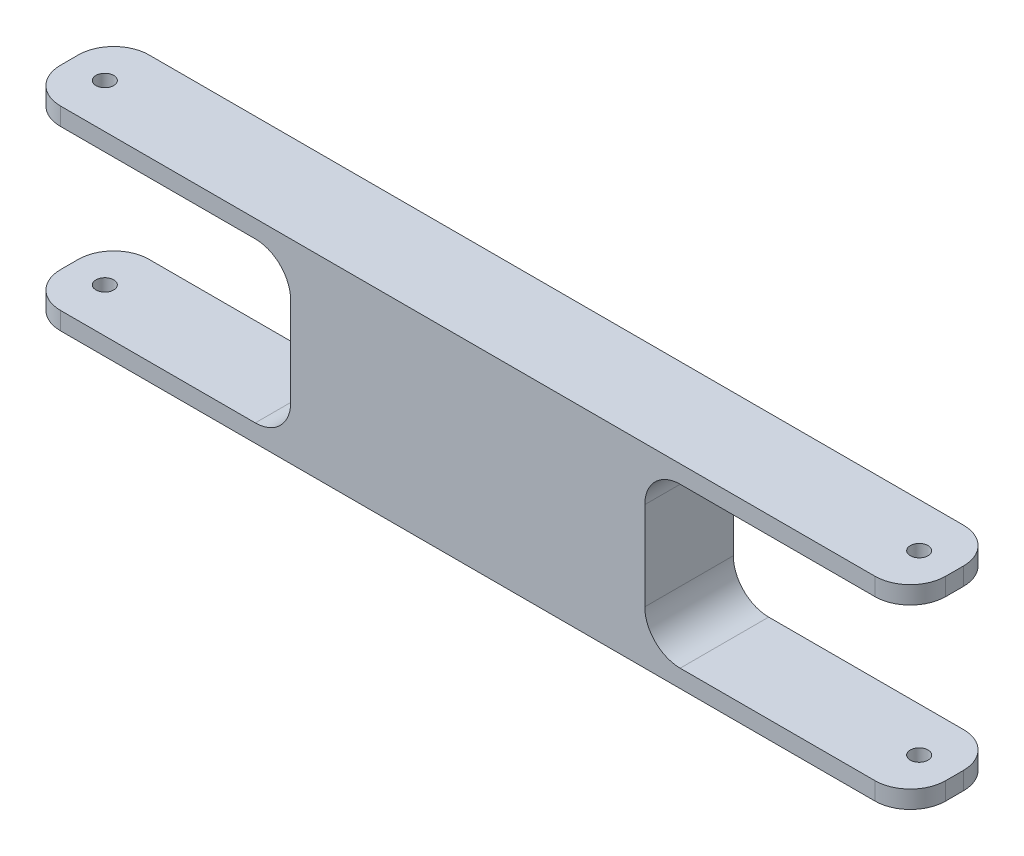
from build123d import *

# Parameters (mm, degrees)
SKETCH_1_W          = 250
SKETCH_1_H          = 55
EXTRUDE_1_DEPTH     = 25
SKETCH_2_W          = 75
SKETCH_2_H          = 45
CUT_EXTRUDE_1_DEPTH = 30
FILLET_1_R          = 10
FILLET_2_R          = 10
SKETCH_3_R          = 2.5
CUT_EXTRUDE_3_DEPTH = 139.834433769


with BuildPart() as part:
    # Sketch 1 → Extrude 1 (new body)
    with BuildSketch(Plane.XY):
        Rectangle(SKETCH_1_W, SKETCH_1_H)
    extrude(amount=EXTRUDE_1_DEPTH)

    # Sketch 2 → Cut-Extrude 1 (cut)
    with BuildSketch(Plane.XY.offset(25)):
        with Locations((87.5, 0)):
            Rectangle(SKETCH_2_W, SKETCH_2_H)
        with Locations((-87.5, 0)):
            Rectangle(SKETCH_2_W, SKETCH_2_H)
    extrude(amount=-CUT_EXTRUDE_1_DEPTH, mode=Mode.SUBTRACT)

    # Fillet 1
    fillet_1_edges = [part.edges().sort_by_distance(p)[0] for p in [
        (50, -22.5, 12.5),
        (50, 22.5, 12.5),
        (-50, 22.5, 12.5),
        (-50, -22.5, 12.5),
    ]]
    fillet(fillet_1_edges, radius=FILLET_1_R)

    # Fillet 2
    fillet_2_edges = [part.edges().sort_by_distance(p)[0] for p in [
        (125, -25, 25),
        (-125, -25, 0),
        (125, 25, 0),
        (-125, -25, 25),
        (125, 25, 25),
        (-125, 25, 25),
        (125, -25, 0),
        (-125, 25, 0),
    ]]
    fillet(fillet_2_edges, radius=FILLET_2_R)

    # Sketch 3 → Cut-Extrude 3 (cut, through all)
    with BuildSketch(Plane.XZ.offset(27.5)):
        with Locations((115, 12.5)):
            Circle(SKETCH_3_R)
        with Locations(Location((-115, 12.5, 0), (0, 0, 270))):
            Circle(SKETCH_3_R)
    extrude(amount=-CUT_EXTRUDE_3_DEPTH, mode=Mode.SUBTRACT)


solid = part.part
